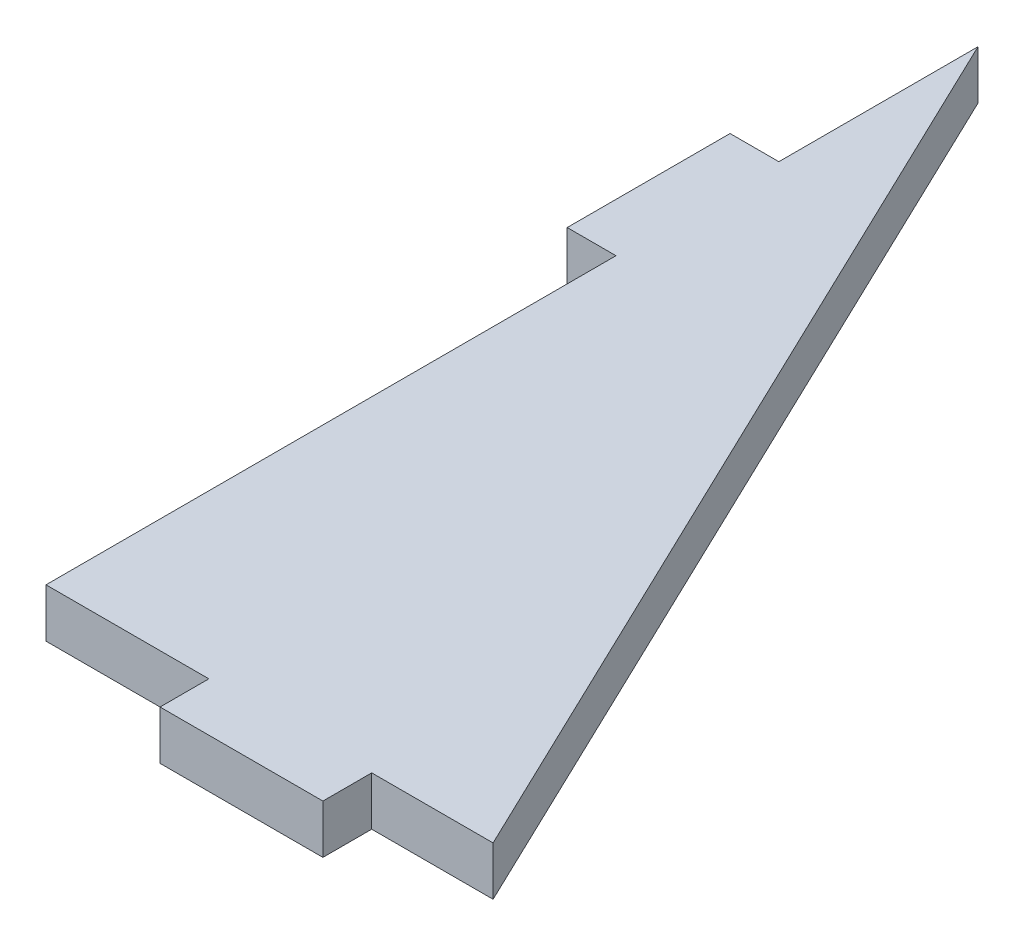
ISO-10303-21;
HEADER;
FILE_DESCRIPTION(('STEP AP214'),'2;1');
FILE_NAME('part.step','',(''),(''),'','','');
FILE_SCHEMA(('AUTOMOTIVE_DESIGN { 1 0 10303 214 1 1 1 1 }'));
ENDSEC;
DATA;
#1=APPLICATION_CONTEXT('core data for automotive mechanical design processes');
#2=APPLICATION_PROTOCOL_DEFINITION('international standard','automotive_design',2000,#1);
#3=PRODUCT_CONTEXT('',#1,'mechanical');
#4=PRODUCT('Part','Part','',(#3));
#5=PRODUCT_RELATED_PRODUCT_CATEGORY('part','',(#4));
#6=PRODUCT_DEFINITION_FORMATION('','',#4);
#7=PRODUCT_DEFINITION_CONTEXT('part definition',#1,'design');
#8=PRODUCT_DEFINITION('design','',#6,#7);
#9=PRODUCT_DEFINITION_SHAPE('','',#8);
#10=(LENGTH_UNIT() NAMED_UNIT(*) SI_UNIT(.MILLI.,.METRE.));
#11=(NAMED_UNIT(*) PLANE_ANGLE_UNIT() SI_UNIT($,.RADIAN.));
#12=(NAMED_UNIT(*) SI_UNIT($,.STERADIAN.) SOLID_ANGLE_UNIT());
#13=UNCERTAINTY_MEASURE_WITH_UNIT(LENGTH_MEASURE(1.E-05),#10,'distance_accuracy_value','');
#14=(GEOMETRIC_REPRESENTATION_CONTEXT(3) GLOBAL_UNCERTAINTY_ASSIGNED_CONTEXT((#13)) GLOBAL_UNIT_ASSIGNED_CONTEXT((#10,
#11,#12)) REPRESENTATION_CONTEXT('',''));
#15=CARTESIAN_POINT('',(0.,0.,0.));
#16=DIRECTION('',(0.,0.,1.));
#17=DIRECTION('',(1.,0.,0.));
#18=AXIS2_PLACEMENT_3D('',#15,#16,#17);
#19=CARTESIAN_POINT('',(0.,2.9972,0.));
#20=DIRECTION('',(-1.,0.,0.));
#21=DIRECTION('',(0.,0.,1.));
#22=AXIS2_PLACEMENT_3D('',#19,#20,#21);
#23=PLANE('',#22);
#24=DIRECTION('',(0.,-1.,0.));
#25=VECTOR('',#24,1.);
#26=CARTESIAN_POINT('',(0.,2.9972,-45.));
#27=LINE('',#26,#25);
#28=CARTESIAN_POINT('',(0.,2.9972,-45.));
#29=VERTEX_POINT('',#28);
#30=CARTESIAN_POINT('',(0.,0.,-45.));
#31=VERTEX_POINT('',#30);
#32=EDGE_CURVE('E129',#29,#31,#27,.T.);
#33=ORIENTED_EDGE('',*,*,#32,.F.);
#34=DIRECTION('',(0.,0.,-1.));
#35=VECTOR('',#34,1.);
#36=CARTESIAN_POINT('',(0.,2.9972,0.));
#37=LINE('',#36,#35);
#38=CARTESIAN_POINT('',(0.,2.9972,-57.227607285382));
#39=VERTEX_POINT('',#38);
#40=EDGE_CURVE('E305',#29,#39,#37,.T.);
#41=ORIENTED_EDGE('',*,*,#40,.T.);
#42=DIRECTION('',(0.,-1.,0.));
#43=VECTOR('',#42,1.);
#44=CARTESIAN_POINT('',(0.,2.9972,-57.227607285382));
#45=LINE('',#44,#43);
#46=CARTESIAN_POINT('',(0.,0.,-57.227607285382));
#47=VERTEX_POINT('',#46);
#48=EDGE_CURVE('E191',#39,#47,#45,.T.);
#49=ORIENTED_EDGE('',*,*,#48,.T.);
#50=DIRECTION('',(0.,0.,-1.));
#51=VECTOR('',#50,1.);
#52=CARTESIAN_POINT('',(0.,0.,0.));
#53=LINE('',#52,#51);
#54=EDGE_CURVE('E207',#31,#47,#53,.T.);
#55=ORIENTED_EDGE('',*,*,#54,.F.);
#56=EDGE_LOOP('',(#33,#41,#49,#55));
#57=FACE_BOUND('',#56,.T.);
#58=ADVANCED_FACE('F119',(#57),#23,.T.);
#59=CARTESIAN_POINT('',(0.,0.,0.));
#60=DIRECTION('',(0.,1.,0.));
#61=DIRECTION('',(0.,0.,1.));
#62=AXIS2_PLACEMENT_3D('',#59,#60,#61);
#63=PLANE('',#62);
#64=DIRECTION('',(-1.,0.,0.));
#65=VECTOR('',#64,1.);
#66=CARTESIAN_POINT('',(0.,0.,0.));
#67=LINE('',#66,#65);
#68=CARTESIAN_POINT('',(27.4518846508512,0.,0.));
#69=VERTEX_POINT('',#68);
#70=CARTESIAN_POINT('',(20.,0.,0.));
#71=VERTEX_POINT('',#70);
#72=EDGE_CURVE('E212',#69,#71,#67,.T.);
#73=ORIENTED_EDGE('',*,*,#72,.T.);
#74=DIRECTION('',(0.,0.,1.));
#75=VECTOR('',#74,1.);
#76=CARTESIAN_POINT('',(20.,0.,0.));
#77=LINE('',#76,#75);
#78=CARTESIAN_POINT('',(20.,0.,2.9972));
#79=VERTEX_POINT('',#78);
#80=EDGE_CURVE('E222',#71,#79,#77,.T.);
#81=ORIENTED_EDGE('',*,*,#80,.T.);
#82=DIRECTION('',(-1.,0.,0.));
#83=VECTOR('',#82,1.);
#84=CARTESIAN_POINT('',(0.,0.,2.9972));
#85=LINE('',#84,#83);
#86=CARTESIAN_POINT('',(10.,0.,2.9972));
#87=VERTEX_POINT('',#86);
#88=EDGE_CURVE('E219',#79,#87,#85,.T.);
#89=ORIENTED_EDGE('',*,*,#88,.T.);
#90=DIRECTION('',(0.,0.,1.));
#91=VECTOR('',#90,1.);
#92=CARTESIAN_POINT('',(10.,0.,0.));
#93=LINE('',#92,#91);
#94=CARTESIAN_POINT('',(10.,0.,0.));
#95=VERTEX_POINT('',#94);
#96=EDGE_CURVE('E216',#95,#87,#93,.T.);
#97=ORIENTED_EDGE('',*,*,#96,.F.);
#98=CARTESIAN_POINT('',(0.,0.,0.));
#99=VERTEX_POINT('',#98);
#100=EDGE_CURVE('E211',#95,#99,#67,.T.);
#101=ORIENTED_EDGE('',*,*,#100,.T.);
#102=CARTESIAN_POINT('',(0.,0.,-35.));
#103=VERTEX_POINT('',#102);
#104=EDGE_CURVE('E180',#99,#103,#53,.T.);
#105=ORIENTED_EDGE('',*,*,#104,.T.);
#106=DIRECTION('',(-1.,0.,0.));
#107=VECTOR('',#106,1.);
#108=CARTESIAN_POINT('',(0.,0.,-35.));
#109=LINE('',#108,#107);
#110=CARTESIAN_POINT('',(-2.9972,0.,-35.));
#111=VERTEX_POINT('',#110);
#112=EDGE_CURVE('E166',#103,#111,#109,.T.);
#113=ORIENTED_EDGE('',*,*,#112,.T.);
#114=DIRECTION('',(0.,0.,1.));
#115=VECTOR('',#114,1.);
#116=CARTESIAN_POINT('',(-2.99720000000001,0.,-45.));
#117=LINE('',#116,#115);
#118=CARTESIAN_POINT('',(-2.99720000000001,0.,-45.));
#119=VERTEX_POINT('',#118);
#120=EDGE_CURVE('E156',#119,#111,#117,.T.);
#121=ORIENTED_EDGE('',*,*,#120,.F.);
#122=DIRECTION('',(-1.,0.,0.));
#123=VECTOR('',#122,1.);
#124=CARTESIAN_POINT('',(0.,0.,-45.));
#125=LINE('',#124,#123);
#126=EDGE_CURVE('E174',#31,#119,#125,.T.);
#127=ORIENTED_EDGE('',*,*,#126,.F.);
#128=ORIENTED_EDGE('',*,*,#54,.T.);
#129=DIRECTION('',(0.432508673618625,0.,0.901629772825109));
#130=VECTOR('',#129,1.);
#131=CARTESIAN_POINT('',(22.3166320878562,0.,-10.7052109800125));
#132=LINE('',#131,#130);
#133=EDGE_CURVE('E209',#47,#69,#132,.T.);
#134=ORIENTED_EDGE('',*,*,#133,.T.);
#135=EDGE_LOOP('',(#73,#81,#89,#97,#101,#105,#113,#121,#127,#128,#134));
#136=FACE_BOUND('',#135,.T.);
#137=ADVANCED_FACE('F177',(#136),#63,.F.);
#138=CARTESIAN_POINT('',(0.,2.9972,0.));
#139=VERTEX_POINT('',#138);
#140=CARTESIAN_POINT('',(0.,2.9972,-35.));
#141=VERTEX_POINT('',#140);
#142=EDGE_CURVE('E307',#139,#141,#37,.T.);
#143=ORIENTED_EDGE('',*,*,#142,.T.);
#144=DIRECTION('',(0.,-1.,0.));
#145=VECTOR('',#144,1.);
#146=CARTESIAN_POINT('',(0.,2.9972,-35.));
#147=LINE('',#146,#145);
#148=EDGE_CURVE('E12',#141,#103,#147,.T.);
#149=ORIENTED_EDGE('',*,*,#148,.T.);
#150=ORIENTED_EDGE('',*,*,#104,.F.);
#151=DIRECTION('',(0.,-1.,0.));
#152=VECTOR('',#151,1.);
#153=CARTESIAN_POINT('',(0.,2.9972,0.));
#154=LINE('',#153,#152);
#155=EDGE_CURVE('E199',#139,#99,#154,.T.);
#156=ORIENTED_EDGE('',*,*,#155,.F.);
#157=EDGE_LOOP('',(#143,#149,#150,#156));
#158=FACE_BOUND('',#157,.T.);
#159=ADVANCED_FACE('F254',(#158),#23,.T.);
#160=CARTESIAN_POINT('',(0.,2.9972,0.));
#161=DIRECTION('',(0.,0.,1.));
#162=DIRECTION('',(1.,0.,0.));
#163=AXIS2_PLACEMENT_3D('',#160,#161,#162);
#164=PLANE('',#163);
#165=ORIENTED_EDGE('',*,*,#100,.F.);
#166=DIRECTION('',(0.,-1.,0.));
#167=VECTOR('',#166,1.);
#168=CARTESIAN_POINT('',(10.,2.9972,0.));
#169=LINE('',#168,#167);
#170=CARTESIAN_POINT('',(10.,2.9972,0.));
#171=VERTEX_POINT('',#170);
#172=EDGE_CURVE('E236',#171,#95,#169,.T.);
#173=ORIENTED_EDGE('',*,*,#172,.F.);
#174=DIRECTION('',(-1.,0.,0.));
#175=VECTOR('',#174,1.);
#176=CARTESIAN_POINT('',(0.,2.9972,0.));
#177=LINE('',#176,#175);
#178=EDGE_CURVE('E249',#171,#139,#177,.T.);
#179=ORIENTED_EDGE('',*,*,#178,.T.);
#180=ORIENTED_EDGE('',*,*,#155,.T.);
#181=EDGE_LOOP('',(#165,#173,#179,#180));
#182=FACE_BOUND('',#181,.T.);
#183=ADVANCED_FACE('F244',(#182),#164,.T.);
#184=ORIENTED_EDGE('',*,*,#72,.F.);
#185=DIRECTION('',(0.,-1.,0.));
#186=VECTOR('',#185,1.);
#187=CARTESIAN_POINT('',(27.4518846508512,2.9972,0.));
#188=LINE('',#187,#186);
#189=CARTESIAN_POINT('',(27.4518846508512,2.9972,0.));
#190=VERTEX_POINT('',#189);
#191=EDGE_CURVE('E188',#190,#69,#188,.T.);
#192=ORIENTED_EDGE('',*,*,#191,.F.);
#193=CARTESIAN_POINT('',(20.,2.9972,0.));
#194=VERTEX_POINT('',#193);
#195=EDGE_CURVE('E225',#190,#194,#177,.T.);
#196=ORIENTED_EDGE('',*,*,#195,.T.);
#197=DIRECTION('',(0.,-1.,0.));
#198=VECTOR('',#197,1.);
#199=CARTESIAN_POINT('',(20.,2.9972,0.));
#200=LINE('',#199,#198);
#201=EDGE_CURVE('E226',#194,#71,#200,.T.);
#202=ORIENTED_EDGE('',*,*,#201,.T.);
#203=EDGE_LOOP('',(#184,#192,#196,#202));
#204=FACE_BOUND('',#203,.T.);
#205=ADVANCED_FACE('F297',(#204),#164,.T.);
#206=CARTESIAN_POINT('',(22.3166320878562,2.9972,-10.7052109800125));
#207=DIRECTION('',(0.901629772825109,0.,-0.432508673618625));
#208=DIRECTION('',(-0.432508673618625,0.,-0.901629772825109));
#209=AXIS2_PLACEMENT_3D('',#206,#207,#208);
#210=PLANE('',#209);
#211=ORIENTED_EDGE('',*,*,#133,.F.);
#212=ORIENTED_EDGE('',*,*,#48,.F.);
#213=DIRECTION('',(0.432508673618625,0.,0.901629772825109));
#214=VECTOR('',#213,1.);
#215=CARTESIAN_POINT('',(22.3166320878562,2.9972,-10.7052109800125));
#216=LINE('',#215,#214);
#217=EDGE_CURVE('E302',#39,#190,#216,.T.);
#218=ORIENTED_EDGE('',*,*,#217,.T.);
#219=ORIENTED_EDGE('',*,*,#191,.T.);
#220=EDGE_LOOP('',(#211,#212,#218,#219));
#221=FACE_BOUND('',#220,.T.);
#222=ADVANCED_FACE('F304',(#221),#210,.T.);
#223=CARTESIAN_POINT('',(0.,2.9972,0.));
#224=DIRECTION('',(0.,1.,0.));
#225=DIRECTION('',(0.,0.,1.));
#226=AXIS2_PLACEMENT_3D('',#223,#224,#225);
#227=PLANE('',#226);
#228=ORIENTED_EDGE('',*,*,#178,.F.);
#229=DIRECTION('',(0.,0.,1.));
#230=VECTOR('',#229,1.);
#231=CARTESIAN_POINT('',(10.,2.9972,0.));
#232=LINE('',#231,#230);
#233=CARTESIAN_POINT('',(10.,2.9972,2.9972));
#234=VERTEX_POINT('',#233);
#235=EDGE_CURVE('E310',#171,#234,#232,.T.);
#236=ORIENTED_EDGE('',*,*,#235,.T.);
#237=DIRECTION('',(-1.,0.,0.));
#238=VECTOR('',#237,1.);
#239=CARTESIAN_POINT('',(0.,2.9972,2.9972));
#240=LINE('',#239,#238);
#241=CARTESIAN_POINT('',(20.,2.9972,2.9972));
#242=VERTEX_POINT('',#241);
#243=EDGE_CURVE('E312',#242,#234,#240,.T.);
#244=ORIENTED_EDGE('',*,*,#243,.F.);
#245=DIRECTION('',(0.,0.,1.));
#246=VECTOR('',#245,1.);
#247=CARTESIAN_POINT('',(20.,2.9972,0.));
#248=LINE('',#247,#246);
#249=EDGE_CURVE('E230',#194,#242,#248,.T.);
#250=ORIENTED_EDGE('',*,*,#249,.F.);
#251=ORIENTED_EDGE('',*,*,#195,.F.);
#252=ORIENTED_EDGE('',*,*,#217,.F.);
#253=ORIENTED_EDGE('',*,*,#40,.F.);
#254=DIRECTION('',(-1.,0.,0.));
#255=VECTOR('',#254,1.);
#256=CARTESIAN_POINT('',(0.,2.9972,-45.));
#257=LINE('',#256,#255);
#258=CARTESIAN_POINT('',(-2.99720000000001,2.9972,-45.));
#259=VERTEX_POINT('',#258);
#260=EDGE_CURVE('E181',#29,#259,#257,.T.);
#261=ORIENTED_EDGE('',*,*,#260,.T.);
#262=DIRECTION('',(0.,0.,1.));
#263=VECTOR('',#262,1.);
#264=CARTESIAN_POINT('',(-2.99720000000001,2.9972,-45.));
#265=LINE('',#264,#263);
#266=CARTESIAN_POINT('',(-2.9972,2.9972,-35.));
#267=VERTEX_POINT('',#266);
#268=EDGE_CURVE('E184',#259,#267,#265,.T.);
#269=ORIENTED_EDGE('',*,*,#268,.T.);
#270=DIRECTION('',(-1.,0.,0.));
#271=VECTOR('',#270,1.);
#272=CARTESIAN_POINT('',(0.,2.9972,-35.));
#273=LINE('',#272,#271);
#274=EDGE_CURVE('E169',#141,#267,#273,.T.);
#275=ORIENTED_EDGE('',*,*,#274,.F.);
#276=ORIENTED_EDGE('',*,*,#142,.F.);
#277=EDGE_LOOP('',(#228,#236,#244,#250,#251,#252,#253,#261,#269,#275,#276));
#278=FACE_BOUND('',#277,.T.);
#279=ADVANCED_FACE('F300',(#278),#227,.T.);
#280=CARTESIAN_POINT('',(-2.99720000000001,2.9972,-45.));
#281=DIRECTION('',(1.,0.,0.));
#282=DIRECTION('',(0.,0.,-1.));
#283=AXIS2_PLACEMENT_3D('',#280,#281,#282);
#284=PLANE('',#283);
#285=ORIENTED_EDGE('',*,*,#120,.T.);
#286=DIRECTION('',(0.,-1.,0.));
#287=VECTOR('',#286,1.);
#288=CARTESIAN_POINT('',(-2.9972,2.9972,-35.));
#289=LINE('',#288,#287);
#290=EDGE_CURVE('E163',#267,#111,#289,.T.);
#291=ORIENTED_EDGE('',*,*,#290,.F.);
#292=ORIENTED_EDGE('',*,*,#268,.F.);
#293=DIRECTION('',(0.,-1.,0.));
#294=VECTOR('',#293,1.);
#295=CARTESIAN_POINT('',(-2.99720000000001,2.9972,-45.));
#296=LINE('',#295,#294);
#297=EDGE_CURVE('E123',#259,#119,#296,.T.);
#298=ORIENTED_EDGE('',*,*,#297,.T.);
#299=EDGE_LOOP('',(#285,#291,#292,#298));
#300=FACE_BOUND('',#299,.T.);
#301=ADVANCED_FACE('F171',(#300),#284,.F.);
#302=CARTESIAN_POINT('',(0.,2.9972,-35.));
#303=DIRECTION('',(0.,0.,1.));
#304=DIRECTION('',(1.,0.,0.));
#305=AXIS2_PLACEMENT_3D('',#302,#303,#304);
#306=PLANE('',#305);
#307=ORIENTED_EDGE('',*,*,#112,.F.);
#308=ORIENTED_EDGE('',*,*,#148,.F.);
#309=ORIENTED_EDGE('',*,*,#274,.T.);
#310=ORIENTED_EDGE('',*,*,#290,.T.);
#311=EDGE_LOOP('',(#307,#308,#309,#310));
#312=FACE_BOUND('',#311,.T.);
#313=ADVANCED_FACE('F164',(#312),#306,.T.);
#314=CARTESIAN_POINT('',(0.,2.9972,-45.));
#315=DIRECTION('',(0.,0.,1.));
#316=DIRECTION('',(1.,0.,0.));
#317=AXIS2_PLACEMENT_3D('',#314,#315,#316);
#318=PLANE('',#317);
#319=ORIENTED_EDGE('',*,*,#126,.T.);
#320=ORIENTED_EDGE('',*,*,#297,.F.);
#321=ORIENTED_EDGE('',*,*,#260,.F.);
#322=ORIENTED_EDGE('',*,*,#32,.T.);
#323=EDGE_LOOP('',(#319,#320,#321,#322));
#324=FACE_BOUND('',#323,.T.);
#325=ADVANCED_FACE('F121',(#324),#318,.F.);
#326=CARTESIAN_POINT('',(10.,2.9972,0.));
#327=DIRECTION('',(1.,0.,0.));
#328=DIRECTION('',(0.,0.,-1.));
#329=AXIS2_PLACEMENT_3D('',#326,#327,#328);
#330=PLANE('',#329);
#331=ORIENTED_EDGE('',*,*,#96,.T.);
#332=DIRECTION('',(0.,-1.,0.));
#333=VECTOR('',#332,1.);
#334=CARTESIAN_POINT('',(10.,2.9972,2.9972));
#335=LINE('',#334,#333);
#336=EDGE_CURVE('E233',#234,#87,#335,.T.);
#337=ORIENTED_EDGE('',*,*,#336,.F.);
#338=ORIENTED_EDGE('',*,*,#235,.F.);
#339=ORIENTED_EDGE('',*,*,#172,.T.);
#340=EDGE_LOOP('',(#331,#337,#338,#339));
#341=FACE_BOUND('',#340,.T.);
#342=ADVANCED_FACE('F315',(#341),#330,.F.);
#343=CARTESIAN_POINT('',(0.,2.9972,2.9972));
#344=DIRECTION('',(0.,0.,1.));
#345=DIRECTION('',(1.,0.,0.));
#346=AXIS2_PLACEMENT_3D('',#343,#344,#345);
#347=PLANE('',#346);
#348=ORIENTED_EDGE('',*,*,#88,.F.);
#349=DIRECTION('',(0.,-1.,0.));
#350=VECTOR('',#349,1.);
#351=CARTESIAN_POINT('',(20.,2.9972,2.9972));
#352=LINE('',#351,#350);
#353=EDGE_CURVE('E229',#242,#79,#352,.T.);
#354=ORIENTED_EDGE('',*,*,#353,.F.);
#355=ORIENTED_EDGE('',*,*,#243,.T.);
#356=ORIENTED_EDGE('',*,*,#336,.T.);
#357=EDGE_LOOP('',(#348,#354,#355,#356));
#358=FACE_BOUND('',#357,.T.);
#359=ADVANCED_FACE('F278',(#358),#347,.T.);
#360=CARTESIAN_POINT('',(20.,2.9972,0.));
#361=DIRECTION('',(1.,0.,0.));
#362=DIRECTION('',(0.,0.,-1.));
#363=AXIS2_PLACEMENT_3D('',#360,#361,#362);
#364=PLANE('',#363);
#365=ORIENTED_EDGE('',*,*,#80,.F.);
#366=ORIENTED_EDGE('',*,*,#201,.F.);
#367=ORIENTED_EDGE('',*,*,#249,.T.);
#368=ORIENTED_EDGE('',*,*,#353,.T.);
#369=EDGE_LOOP('',(#365,#366,#367,#368));
#370=FACE_BOUND('',#369,.T.);
#371=ADVANCED_FACE('F265',(#370),#364,.T.);
#372=CLOSED_SHELL('',(#58,#137,#159,#183,#205,#222,#279,#301,#313,#325,#342,#359,#371));
#373=MANIFOLD_SOLID_BREP('B2',#372);
#374=ADVANCED_BREP_SHAPE_REPRESENTATION('',(#18,#373),#14);
#375=SHAPE_DEFINITION_REPRESENTATION(#9,#374);
ENDSEC;
END-ISO-10303-21;
